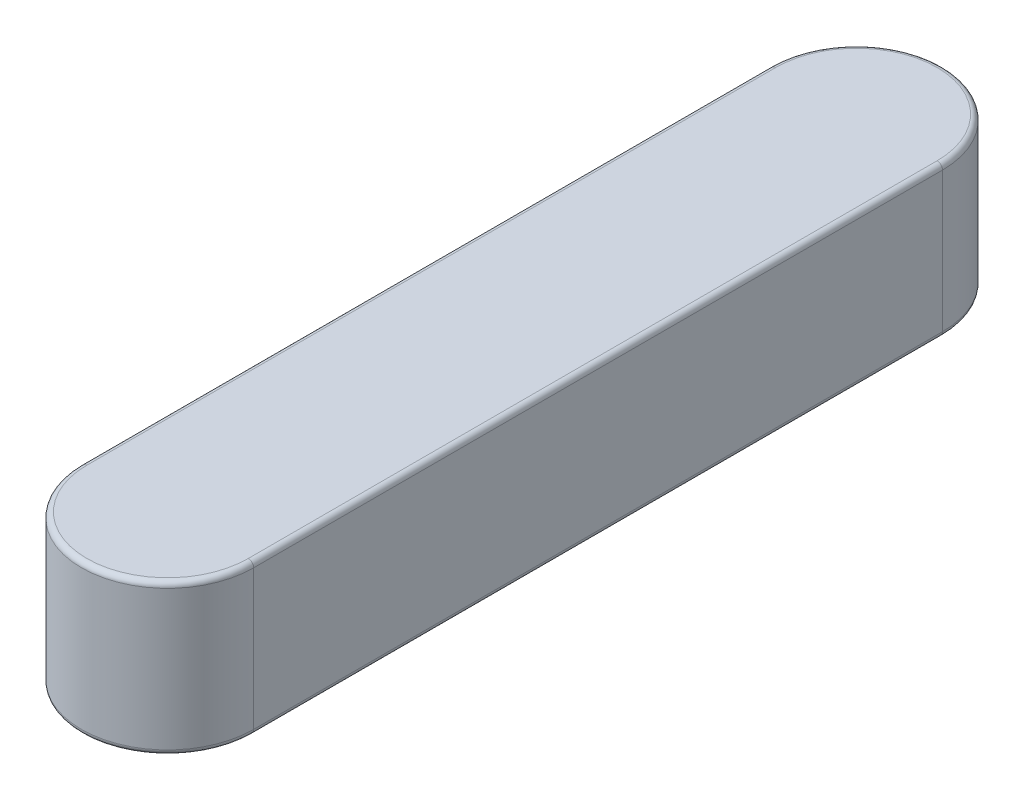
ISO-10303-21;
HEADER;
FILE_DESCRIPTION(('STEP AP214'),'2;1');
FILE_NAME('part.step','',(''),(''),'','','');
FILE_SCHEMA(('AUTOMOTIVE_DESIGN { 1 0 10303 214 1 1 1 1 }'));
ENDSEC;
DATA;
#1=APPLICATION_CONTEXT('core data for automotive mechanical design processes');
#2=APPLICATION_PROTOCOL_DEFINITION('international standard','automotive_design',2000,#1);
#3=PRODUCT_CONTEXT('',#1,'mechanical');
#4=PRODUCT('Part','Part','',(#3));
#5=PRODUCT_RELATED_PRODUCT_CATEGORY('part','',(#4));
#6=PRODUCT_DEFINITION_FORMATION('','',#4);
#7=PRODUCT_DEFINITION_CONTEXT('part definition',#1,'design');
#8=PRODUCT_DEFINITION('design','',#6,#7);
#9=PRODUCT_DEFINITION_SHAPE('','',#8);
#10=(LENGTH_UNIT() NAMED_UNIT(*) SI_UNIT(.MILLI.,.METRE.));
#11=(NAMED_UNIT(*) PLANE_ANGLE_UNIT() SI_UNIT($,.RADIAN.));
#12=(NAMED_UNIT(*) SI_UNIT($,.STERADIAN.) SOLID_ANGLE_UNIT());
#13=UNCERTAINTY_MEASURE_WITH_UNIT(LENGTH_MEASURE(1.E-05),#10,'distance_accuracy_value','');
#14=(GEOMETRIC_REPRESENTATION_CONTEXT(3) GLOBAL_UNCERTAINTY_ASSIGNED_CONTEXT((#13)) GLOBAL_UNIT_ASSIGNED_CONTEXT((#10,
#11,#12)) REPRESENTATION_CONTEXT('',''));
#15=CARTESIAN_POINT('',(0.,0.,0.));
#16=DIRECTION('',(0.,0.,1.));
#17=DIRECTION('',(1.,0.,0.));
#18=AXIS2_PLACEMENT_3D('',#15,#16,#17);
#19=CARTESIAN_POINT('',(0.,7.,-32.));
#20=DIRECTION('',(0.,-1.,0.));
#21=DIRECTION('',(0.,0.,-1.));
#22=AXIS2_PLACEMENT_3D('',#19,#20,#21);
#23=CYLINDRICAL_SURFACE('',#22,4.);
#24=DIRECTION('',(0.,-1.,0.));
#25=VECTOR('',#24,1.);
#26=CARTESIAN_POINT('',(3.99999999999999,7.,-32.));
#27=LINE('',#26,#25);
#28=CARTESIAN_POINT('',(3.99999999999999,6.75,-32.));
#29=VERTEX_POINT('',#28);
#30=CARTESIAN_POINT('',(3.99999999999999,0.25,-32.));
#31=VERTEX_POINT('',#30);
#32=EDGE_CURVE('E152',#29,#31,#27,.T.);
#33=ORIENTED_EDGE('',*,*,#32,.T.);
#34=CARTESIAN_POINT('',(0.,0.25,-32.));
#35=DIRECTION('',(0.,1.,0.));
#36=DIRECTION('',(0.,0.,1.));
#37=AXIS2_PLACEMENT_3D('',#34,#35,#36);
#38=CIRCLE('',#37,4.);
#39=CARTESIAN_POINT('',(-4.,0.25,-32.));
#40=VERTEX_POINT('',#39);
#41=EDGE_CURVE('E176',#31,#40,#38,.T.);
#42=ORIENTED_EDGE('',*,*,#41,.T.);
#43=DIRECTION('',(0.,-1.,0.));
#44=VECTOR('',#43,1.);
#45=CARTESIAN_POINT('',(-4.,7.,-32.));
#46=LINE('',#45,#44);
#47=CARTESIAN_POINT('',(-4.,6.75,-32.));
#48=VERTEX_POINT('',#47);
#49=EDGE_CURVE('E118',#48,#40,#46,.T.);
#50=ORIENTED_EDGE('',*,*,#49,.F.);
#51=CARTESIAN_POINT('',(0.,6.75,-32.));
#52=DIRECTION('',(0.,1.,0.));
#53=DIRECTION('',(0.,0.,1.));
#54=AXIS2_PLACEMENT_3D('',#51,#52,#53);
#55=CIRCLE('',#54,4.);
#56=EDGE_CURVE('E174',#48,#29,#55,.F.);
#57=ORIENTED_EDGE('',*,*,#56,.T.);
#58=EDGE_LOOP('',(#33,#42,#50,#57));
#59=FACE_BOUND('',#58,.T.);
#60=ADVANCED_FACE('F30',(#59),#23,.T.);
#61=CARTESIAN_POINT('',(-4.,7.,0.));
#62=DIRECTION('',(1.,0.,0.));
#63=DIRECTION('',(0.,0.,-1.));
#64=AXIS2_PLACEMENT_3D('',#61,#62,#63);
#65=PLANE('',#64);
#66=ORIENTED_EDGE('',*,*,#49,.T.);
#67=DIRECTION('',(0.,0.,1.));
#68=VECTOR('',#67,1.);
#69=CARTESIAN_POINT('',(-4.,0.25,0.));
#70=LINE('',#69,#68);
#71=CARTESIAN_POINT('',(-4.,0.25,0.));
#72=VERTEX_POINT('',#71);
#73=EDGE_CURVE('E117',#40,#72,#70,.T.);
#74=ORIENTED_EDGE('',*,*,#73,.T.);
#75=DIRECTION('',(0.,-1.,0.));
#76=VECTOR('',#75,1.);
#77=CARTESIAN_POINT('',(-4.,7.,0.));
#78=LINE('',#77,#76);
#79=CARTESIAN_POINT('',(-4.,6.75,0.));
#80=VERTEX_POINT('',#79);
#81=EDGE_CURVE('E99',#80,#72,#78,.T.);
#82=ORIENTED_EDGE('',*,*,#81,.F.);
#83=DIRECTION('',(0.,0.,1.));
#84=VECTOR('',#83,1.);
#85=CARTESIAN_POINT('',(-4.,6.75,-32.));
#86=LINE('',#85,#84);
#87=EDGE_CURVE('E114',#80,#48,#86,.F.);
#88=ORIENTED_EDGE('',*,*,#87,.T.);
#89=EDGE_LOOP('',(#66,#74,#82,#88));
#90=FACE_BOUND('',#89,.T.);
#91=ADVANCED_FACE('F113',(#90),#65,.F.);
#92=CARTESIAN_POINT('',(0.,7.,0.));
#93=DIRECTION('',(0.,-1.,0.));
#94=DIRECTION('',(0.,0.,-1.));
#95=AXIS2_PLACEMENT_3D('',#92,#93,#94);
#96=CYLINDRICAL_SURFACE('',#95,4.);
#97=ORIENTED_EDGE('',*,*,#81,.T.);
#98=CARTESIAN_POINT('',(0.,0.25,0.));
#99=DIRECTION('',(0.,1.,0.));
#100=DIRECTION('',(0.,0.,1.));
#101=AXIS2_PLACEMENT_3D('',#98,#99,#100);
#102=CIRCLE('',#101,4.);
#103=CARTESIAN_POINT('',(3.99999999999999,0.25,0.));
#104=VERTEX_POINT('',#103);
#105=EDGE_CURVE('E11',#72,#104,#102,.T.);
#106=ORIENTED_EDGE('',*,*,#105,.T.);
#107=DIRECTION('',(0.,-1.,0.));
#108=VECTOR('',#107,1.);
#109=CARTESIAN_POINT('',(3.99999999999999,7.,0.));
#110=LINE('',#109,#108);
#111=CARTESIAN_POINT('',(3.99999999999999,6.75,0.));
#112=VERTEX_POINT('',#111);
#113=EDGE_CURVE('E101',#112,#104,#110,.T.);
#114=ORIENTED_EDGE('',*,*,#113,.F.);
#115=CARTESIAN_POINT('',(0.,6.75,0.));
#116=DIRECTION('',(0.,1.,0.));
#117=DIRECTION('',(0.,0.,1.));
#118=AXIS2_PLACEMENT_3D('',#115,#116,#117);
#119=CIRCLE('',#118,4.);
#120=EDGE_CURVE('E39',#112,#80,#119,.F.);
#121=ORIENTED_EDGE('',*,*,#120,.T.);
#122=EDGE_LOOP('',(#97,#106,#114,#121));
#123=FACE_BOUND('',#122,.T.);
#124=ADVANCED_FACE('F98',(#123),#96,.T.);
#125=CARTESIAN_POINT('',(3.99999999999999,7.,-32.));
#126=DIRECTION('',(-1.,0.,0.));
#127=DIRECTION('',(0.,0.,1.));
#128=AXIS2_PLACEMENT_3D('',#125,#126,#127);
#129=PLANE('',#128);
#130=ORIENTED_EDGE('',*,*,#113,.T.);
#131=DIRECTION('',(0.,0.,-1.));
#132=VECTOR('',#131,1.);
#133=CARTESIAN_POINT('',(3.99999999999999,0.25,-32.));
#134=LINE('',#133,#132);
#135=EDGE_CURVE('E180',#104,#31,#134,.T.);
#136=ORIENTED_EDGE('',*,*,#135,.T.);
#137=ORIENTED_EDGE('',*,*,#32,.F.);
#138=DIRECTION('',(0.,0.,-1.));
#139=VECTOR('',#138,1.);
#140=CARTESIAN_POINT('',(3.99999999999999,6.75,0.));
#141=LINE('',#140,#139);
#142=EDGE_CURVE('E178',#29,#112,#141,.F.);
#143=ORIENTED_EDGE('',*,*,#142,.T.);
#144=EDGE_LOOP('',(#130,#136,#137,#143));
#145=FACE_BOUND('',#144,.T.);
#146=ADVANCED_FACE('F190',(#145),#129,.F.);
#147=CARTESIAN_POINT('',(0.,7.,-32.));
#148=DIRECTION('',(0.,1.,0.));
#149=DIRECTION('',(0.,0.,1.));
#150=AXIS2_PLACEMENT_3D('',#147,#148,#149);
#151=PLANE('',#150);
#152=CARTESIAN_POINT('',(0.,7.,-32.));
#153=DIRECTION('',(0.,1.,0.));
#154=DIRECTION('',(0.,0.,1.));
#155=AXIS2_PLACEMENT_3D('',#152,#153,#154);
#156=CIRCLE('',#155,3.75);
#157=CARTESIAN_POINT('',(3.74999999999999,7.,-32.));
#158=VERTEX_POINT('',#157);
#159=CARTESIAN_POINT('',(-3.75000000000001,7.,-32.));
#160=VERTEX_POINT('',#159);
#161=EDGE_CURVE('E47',#158,#160,#156,.T.);
#162=ORIENTED_EDGE('',*,*,#161,.T.);
#163=DIRECTION('',(0.,0.,1.));
#164=VECTOR('',#163,1.);
#165=CARTESIAN_POINT('',(-3.75,7.,0.));
#166=LINE('',#165,#164);
#167=CARTESIAN_POINT('',(-3.75,7.,0.));
#168=VERTEX_POINT('',#167);
#169=EDGE_CURVE('E106',#160,#168,#166,.T.);
#170=ORIENTED_EDGE('',*,*,#169,.T.);
#171=CARTESIAN_POINT('',(0.,7.,0.));
#172=DIRECTION('',(0.,1.,0.));
#173=DIRECTION('',(0.,0.,1.));
#174=AXIS2_PLACEMENT_3D('',#171,#172,#173);
#175=CIRCLE('',#174,3.75);
#176=CARTESIAN_POINT('',(3.74999999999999,7.,0.));
#177=VERTEX_POINT('',#176);
#178=EDGE_CURVE('E129',#168,#177,#175,.T.);
#179=ORIENTED_EDGE('',*,*,#178,.T.);
#180=DIRECTION('',(0.,0.,-1.));
#181=VECTOR('',#180,1.);
#182=CARTESIAN_POINT('',(3.74999999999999,7.,-32.));
#183=LINE('',#182,#181);
#184=EDGE_CURVE('E52',#177,#158,#183,.T.);
#185=ORIENTED_EDGE('',*,*,#184,.T.);
#186=EDGE_LOOP('',(#162,#170,#179,#185));
#187=FACE_BOUND('',#186,.T.);
#188=ADVANCED_FACE('F185',(#187),#151,.T.);
#189=CARTESIAN_POINT('',(0.,0.,-32.));
#190=DIRECTION('',(0.,1.,0.));
#191=DIRECTION('',(0.,0.,1.));
#192=AXIS2_PLACEMENT_3D('',#189,#190,#191);
#193=PLANE('',#192);
#194=CARTESIAN_POINT('',(0.,0.,0.));
#195=DIRECTION('',(0.,1.,0.));
#196=DIRECTION('',(0.,0.,1.));
#197=AXIS2_PLACEMENT_3D('',#194,#195,#196);
#198=CIRCLE('',#197,3.75);
#199=CARTESIAN_POINT('',(3.74999999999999,0.,0.));
#200=VERTEX_POINT('',#199);
#201=CARTESIAN_POINT('',(-3.75,0.,0.));
#202=VERTEX_POINT('',#201);
#203=EDGE_CURVE('E165',#200,#202,#198,.F.);
#204=ORIENTED_EDGE('',*,*,#203,.T.);
#205=DIRECTION('',(0.,0.,1.));
#206=VECTOR('',#205,1.);
#207=CARTESIAN_POINT('',(-3.75,0.,-32.));
#208=LINE('',#207,#206);
#209=CARTESIAN_POINT('',(-3.75000000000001,0.,-32.));
#210=VERTEX_POINT('',#209);
#211=EDGE_CURVE('E171',#202,#210,#208,.F.);
#212=ORIENTED_EDGE('',*,*,#211,.T.);
#213=CARTESIAN_POINT('',(0.,0.,-32.));
#214=DIRECTION('',(0.,1.,0.));
#215=DIRECTION('',(0.,0.,1.));
#216=AXIS2_PLACEMENT_3D('',#213,#214,#215);
#217=CIRCLE('',#216,3.75);
#218=CARTESIAN_POINT('',(3.74999999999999,0.,-32.));
#219=VERTEX_POINT('',#218);
#220=EDGE_CURVE('E169',#210,#219,#217,.F.);
#221=ORIENTED_EDGE('',*,*,#220,.T.);
#222=DIRECTION('',(0.,0.,-1.));
#223=VECTOR('',#222,1.);
#224=CARTESIAN_POINT('',(3.74999999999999,0.,-32.));
#225=LINE('',#224,#223);
#226=EDGE_CURVE('E167',#219,#200,#225,.F.);
#227=ORIENTED_EDGE('',*,*,#226,.T.);
#228=EDGE_LOOP('',(#204,#212,#221,#227));
#229=FACE_BOUND('',#228,.T.);
#230=ADVANCED_FACE('F217',(#229),#193,.F.);
#231=CARTESIAN_POINT('',(3.74999999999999,0.25,-32.));
#232=DIRECTION('',(0.,0.,-1.));
#233=DIRECTION('',(-1.,0.,0.));
#234=AXIS2_PLACEMENT_3D('',#231,#232,#233);
#235=CYLINDRICAL_SURFACE('',#234,0.25);
#236=CARTESIAN_POINT('',(3.74999999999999,0.25,0.));
#237=DIRECTION('',(0.,0.,1.));
#238=DIRECTION('',(1.,0.,0.));
#239=AXIS2_PLACEMENT_3D('',#236,#237,#238);
#240=CIRCLE('',#239,0.25);
#241=EDGE_CURVE('E145',#200,#104,#240,.T.);
#242=ORIENTED_EDGE('',*,*,#241,.F.);
#243=ORIENTED_EDGE('',*,*,#226,.F.);
#244=CARTESIAN_POINT('',(3.74999999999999,0.25,-32.));
#245=DIRECTION('',(0.,0.,-1.));
#246=DIRECTION('',(-1.,0.,0.));
#247=AXIS2_PLACEMENT_3D('',#244,#245,#246);
#248=CIRCLE('',#247,0.25);
#249=EDGE_CURVE('E134',#31,#219,#248,.T.);
#250=ORIENTED_EDGE('',*,*,#249,.F.);
#251=ORIENTED_EDGE('',*,*,#135,.F.);
#252=EDGE_LOOP('',(#242,#243,#250,#251));
#253=FACE_BOUND('',#252,.T.);
#254=ADVANCED_FACE('F193',(#253),#235,.T.);
#255=CARTESIAN_POINT('',(0.,0.25,-32.));
#256=DIRECTION('',(0.,1.,0.));
#257=DIRECTION('',(0.,0.,1.));
#258=AXIS2_PLACEMENT_3D('',#255,#256,#257);
#259=TOROIDAL_SURFACE('',#258,3.75,0.25);
#260=ORIENTED_EDGE('',*,*,#249,.T.);
#261=ORIENTED_EDGE('',*,*,#220,.F.);
#262=CARTESIAN_POINT('',(-3.75000000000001,0.25,-32.));
#263=DIRECTION('',(0.,0.,1.));
#264=DIRECTION('',(1.,0.,0.));
#265=AXIS2_PLACEMENT_3D('',#262,#263,#264);
#266=CIRCLE('',#265,0.25);
#267=EDGE_CURVE('E139',#40,#210,#266,.T.);
#268=ORIENTED_EDGE('',*,*,#267,.F.);
#269=ORIENTED_EDGE('',*,*,#41,.F.);
#270=EDGE_LOOP('',(#260,#261,#268,#269));
#271=FACE_BOUND('',#270,.T.);
#272=ADVANCED_FACE('F196',(#271),#259,.T.);
#273=CARTESIAN_POINT('',(0.,0.25,0.));
#274=DIRECTION('',(0.,1.,0.));
#275=DIRECTION('',(0.,0.,1.));
#276=AXIS2_PLACEMENT_3D('',#273,#274,#275);
#277=TOROIDAL_SURFACE('',#276,3.75,0.25);
#278=ORIENTED_EDGE('',*,*,#241,.T.);
#279=ORIENTED_EDGE('',*,*,#105,.F.);
#280=CARTESIAN_POINT('',(-3.75,0.25,0.));
#281=DIRECTION('',(0.,0.,-1.));
#282=DIRECTION('',(-1.,0.,0.));
#283=AXIS2_PLACEMENT_3D('',#280,#281,#282);
#284=CIRCLE('',#283,0.25);
#285=EDGE_CURVE('E137',#202,#72,#284,.T.);
#286=ORIENTED_EDGE('',*,*,#285,.F.);
#287=ORIENTED_EDGE('',*,*,#203,.F.);
#288=EDGE_LOOP('',(#278,#279,#286,#287));
#289=FACE_BOUND('',#288,.T.);
#290=ADVANCED_FACE('F199',(#289),#277,.T.);
#291=CARTESIAN_POINT('',(-3.75,0.25,0.));
#292=DIRECTION('',(0.,0.,1.));
#293=DIRECTION('',(1.,0.,0.));
#294=AXIS2_PLACEMENT_3D('',#291,#292,#293);
#295=CYLINDRICAL_SURFACE('',#294,0.25);
#296=ORIENTED_EDGE('',*,*,#267,.T.);
#297=ORIENTED_EDGE('',*,*,#211,.F.);
#298=ORIENTED_EDGE('',*,*,#285,.T.);
#299=ORIENTED_EDGE('',*,*,#73,.F.);
#300=EDGE_LOOP('',(#296,#297,#298,#299));
#301=FACE_BOUND('',#300,.T.);
#302=ADVANCED_FACE('F197',(#301),#295,.T.);
#303=CARTESIAN_POINT('',(3.74999999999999,6.75,-32.));
#304=DIRECTION('',(0.,0.,1.));
#305=DIRECTION('',(1.,0.,0.));
#306=AXIS2_PLACEMENT_3D('',#303,#304,#305);
#307=CYLINDRICAL_SURFACE('',#306,0.25);
#308=CARTESIAN_POINT('',(3.74999999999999,6.75,0.));
#309=DIRECTION('',(0.,0.,1.));
#310=DIRECTION('',(1.,0.,0.));
#311=AXIS2_PLACEMENT_3D('',#308,#309,#310);
#312=CIRCLE('',#311,0.25);
#313=EDGE_CURVE('E131',#112,#177,#312,.T.);
#314=ORIENTED_EDGE('',*,*,#313,.F.);
#315=ORIENTED_EDGE('',*,*,#142,.F.);
#316=CARTESIAN_POINT('',(3.74999999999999,6.75,-32.));
#317=DIRECTION('',(0.,0.,-1.));
#318=DIRECTION('',(-1.,0.,0.));
#319=AXIS2_PLACEMENT_3D('',#316,#317,#318);
#320=CIRCLE('',#319,0.25);
#321=EDGE_CURVE('E34',#158,#29,#320,.T.);
#322=ORIENTED_EDGE('',*,*,#321,.F.);
#323=ORIENTED_EDGE('',*,*,#184,.F.);
#324=EDGE_LOOP('',(#314,#315,#322,#323));
#325=FACE_BOUND('',#324,.T.);
#326=ADVANCED_FACE('F32',(#325),#307,.T.);
#327=CARTESIAN_POINT('',(0.,6.75,-32.));
#328=DIRECTION('',(0.,1.,0.));
#329=DIRECTION('',(0.,0.,1.));
#330=AXIS2_PLACEMENT_3D('',#327,#328,#329);
#331=TOROIDAL_SURFACE('',#330,3.75,0.25);
#332=ORIENTED_EDGE('',*,*,#321,.T.);
#333=ORIENTED_EDGE('',*,*,#56,.F.);
#334=CARTESIAN_POINT('',(-3.75000000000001,6.75,-32.));
#335=DIRECTION('',(0.,0.,1.));
#336=DIRECTION('',(1.,0.,0.));
#337=AXIS2_PLACEMENT_3D('',#334,#335,#336);
#338=CIRCLE('',#337,0.25);
#339=EDGE_CURVE('E125',#160,#48,#338,.T.);
#340=ORIENTED_EDGE('',*,*,#339,.F.);
#341=ORIENTED_EDGE('',*,*,#161,.F.);
#342=EDGE_LOOP('',(#332,#333,#340,#341));
#343=FACE_BOUND('',#342,.T.);
#344=ADVANCED_FACE('F188',(#343),#331,.T.);
#345=CARTESIAN_POINT('',(0.,6.75,0.));
#346=DIRECTION('',(0.,1.,0.));
#347=DIRECTION('',(0.,0.,1.));
#348=AXIS2_PLACEMENT_3D('',#345,#346,#347);
#349=TOROIDAL_SURFACE('',#348,3.75,0.25);
#350=ORIENTED_EDGE('',*,*,#313,.T.);
#351=ORIENTED_EDGE('',*,*,#178,.F.);
#352=CARTESIAN_POINT('',(-3.75,6.75,0.));
#353=DIRECTION('',(0.,0.,-1.));
#354=DIRECTION('',(0.,1.,0.));
#355=AXIS2_PLACEMENT_3D('',#352,#353,#354);
#356=CIRCLE('',#355,0.25);
#357=EDGE_CURVE('E123',#80,#168,#356,.T.);
#358=ORIENTED_EDGE('',*,*,#357,.F.);
#359=ORIENTED_EDGE('',*,*,#120,.F.);
#360=EDGE_LOOP('',(#350,#351,#358,#359));
#361=FACE_BOUND('',#360,.T.);
#362=ADVANCED_FACE('F128',(#361),#349,.T.);
#363=CARTESIAN_POINT('',(-3.75,6.75,-32.));
#364=DIRECTION('',(0.,0.,-1.));
#365=DIRECTION('',(-1.,0.,0.));
#366=AXIS2_PLACEMENT_3D('',#363,#364,#365);
#367=CYLINDRICAL_SURFACE('',#366,0.25);
#368=ORIENTED_EDGE('',*,*,#339,.T.);
#369=ORIENTED_EDGE('',*,*,#87,.F.);
#370=ORIENTED_EDGE('',*,*,#357,.T.);
#371=ORIENTED_EDGE('',*,*,#169,.F.);
#372=EDGE_LOOP('',(#368,#369,#370,#371));
#373=FACE_BOUND('',#372,.T.);
#374=ADVANCED_FACE('F121',(#373),#367,.T.);
#375=CLOSED_SHELL('',(#60,#91,#124,#146,#188,#230,#254,#272,#290,#302,#326,#344,#362,#374));
#376=MANIFOLD_SOLID_BREP('B2',#375);
#377=ADVANCED_BREP_SHAPE_REPRESENTATION('',(#18,#376),#14);
#378=SHAPE_DEFINITION_REPRESENTATION(#9,#377);
ENDSEC;
END-ISO-10303-21;
